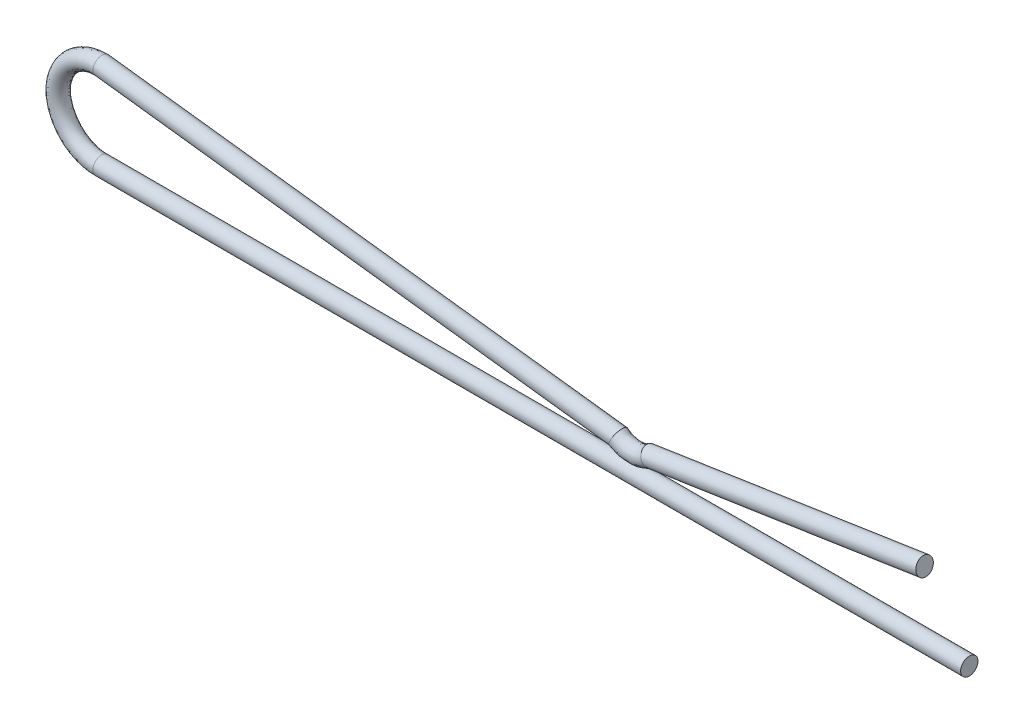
ISO-10303-21;
HEADER;
FILE_DESCRIPTION(('STEP AP214'),'2;1');
FILE_NAME('part.step','',(''),(''),'','','');
FILE_SCHEMA(('AUTOMOTIVE_DESIGN { 1 0 10303 214 1 1 1 1 }'));
ENDSEC;
DATA;
#1=APPLICATION_CONTEXT('core data for automotive mechanical design processes');
#2=APPLICATION_PROTOCOL_DEFINITION('international standard','automotive_design',2000,#1);
#3=PRODUCT_CONTEXT('',#1,'mechanical');
#4=PRODUCT('Part','Part','',(#3));
#5=PRODUCT_RELATED_PRODUCT_CATEGORY('part','',(#4));
#6=PRODUCT_DEFINITION_FORMATION('','',#4);
#7=PRODUCT_DEFINITION_CONTEXT('part definition',#1,'design');
#8=PRODUCT_DEFINITION('design','',#6,#7);
#9=PRODUCT_DEFINITION_SHAPE('','',#8);
#10=(LENGTH_UNIT() NAMED_UNIT(*) SI_UNIT(.MILLI.,.METRE.));
#11=(NAMED_UNIT(*) PLANE_ANGLE_UNIT() SI_UNIT($,.RADIAN.));
#12=(NAMED_UNIT(*) SI_UNIT($,.STERADIAN.) SOLID_ANGLE_UNIT());
#13=UNCERTAINTY_MEASURE_WITH_UNIT(LENGTH_MEASURE(1.E-05),#10,'distance_accuracy_value','');
#14=(GEOMETRIC_REPRESENTATION_CONTEXT(3) GLOBAL_UNCERTAINTY_ASSIGNED_CONTEXT((#13)) GLOBAL_UNIT_ASSIGNED_CONTEXT((#10,
#11,#12)) REPRESENTATION_CONTEXT('',''));
#15=CARTESIAN_POINT('',(0.,0.,0.));
#16=DIRECTION('',(0.,0.,1.));
#17=DIRECTION('',(1.,0.,0.));
#18=AXIS2_PLACEMENT_3D('',#15,#16,#17);
#19=CARTESIAN_POINT('',(-27.2506693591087,-18.6607844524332,0.));
#20=DIRECTION('',(1.,0.,0.));
#21=DIRECTION('',(0.,1.,0.));
#22=AXIS2_PLACEMENT_3D('',#19,#20,#21);
#23=CYLINDRICAL_SURFACE('',#22,0.0999999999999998);
#24=CARTESIAN_POINT('',(-27.2506693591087,-18.6607844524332,0.));
#25=DIRECTION('',(-1.,0.,0.));
#26=DIRECTION('',(0.,-1.,0.));
#27=AXIS2_PLACEMENT_3D('',#24,#25,#26);
#28=CIRCLE('',#27,0.0999999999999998);
#29=CARTESIAN_POINT('',(-27.2506693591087,-18.7607844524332,0.));
#30=VERTEX_POINT('',#29);
#31=EDGE_CURVE('E11',#30,#30,#28,.T.);
#32=ORIENTED_EDGE('',*,*,#31,.F.);
#33=EDGE_LOOP('',(#32));
#34=FACE_BOUND('',#33,.T.);
#35=CARTESIAN_POINT('',(-17.2506693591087,-18.6607844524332,0.));
#36=DIRECTION('',(-1.,0.,0.));
#37=DIRECTION('',(0.,-1.,0.));
#38=AXIS2_PLACEMENT_3D('',#35,#36,#37);
#39=CIRCLE('',#38,0.0999999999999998);
#40=CARTESIAN_POINT('',(-17.2506693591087,-18.7607844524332,0.));
#41=VERTEX_POINT('',#40);
#42=EDGE_CURVE('E43',#41,#41,#39,.T.);
#43=ORIENTED_EDGE('',*,*,#42,.T.);
#44=EDGE_LOOP('',(#43));
#45=FACE_BOUND('',#44,.T.);
#46=ADVANCED_FACE('F40',(#34,#45),#23,.T.);
#47=CARTESIAN_POINT('',(-17.2506693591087,-18.6607844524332,0.));
#48=DIRECTION('',(-1.,0.,0.));
#49=DIRECTION('',(0.,-1.,0.));
#50=AXIS2_PLACEMENT_3D('',#47,#48,#49);
#51=PLANE('',#50);
#52=ORIENTED_EDGE('',*,*,#42,.F.);
#53=EDGE_LOOP('',(#52));
#54=FACE_BOUND('',#53,.T.);
#55=ADVANCED_FACE('F97',(#54),#51,.F.);
#56=CARTESIAN_POINT('',(-27.2506693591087,-18.7607844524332,0.));
#57=CARTESIAN_POINT('',(-27.2730606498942,-18.7607844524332,0.));
#58=CARTESIAN_POINT('',(-27.3366927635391,-18.7571033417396,0.));
#59=CARTESIAN_POINT('',(-27.4232507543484,-18.7384235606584,0.));
#60=CARTESIAN_POINT('',(-27.5201436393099,-18.7007624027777,0.));
#61=CARTESIAN_POINT('',(-27.6088160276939,-18.6464794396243,0.));
#62=CARTESIAN_POINT('',(-27.6905179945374,-18.571954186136,0.));
#63=CARTESIAN_POINT('',(-27.7544950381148,-18.4879166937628,0.));
#64=CARTESIAN_POINT('',(-27.8065709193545,-18.3899068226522,0.));
#65=CARTESIAN_POINT('',(-27.8418276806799,-18.2799655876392,0.));
#66=CARTESIAN_POINT('',(-27.855144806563,-18.1607844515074,0.));
#67=CARTESIAN_POINT('',(-27.8418272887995,-18.0416033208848,0.));
#68=CARTESIAN_POINT('',(-27.8065724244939,-17.9316620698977,0.));
#69=CARTESIAN_POINT('',(-27.7544896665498,-17.8336522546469,0.));
#70=CARTESIAN_POINT('',(-27.6905365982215,-17.7496145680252,0.));
#71=CARTESIAN_POINT('',(-27.6087480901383,-17.6750900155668,0.));
#72=CARTESIAN_POINT('',(-27.5204200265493,-17.6208042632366,0.));
#73=CARTESIAN_POINT('',(-27.422378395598,-17.5831524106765,0.));
#74=CARTESIAN_POINT('',(-27.3391441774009,-17.5643734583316,0.));
#75=CARTESIAN_POINT('',(-27.2669528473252,-17.5607844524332,0.));
#76=CARTESIAN_POINT('',(-27.2445611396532,-17.5607844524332,0.));
#77=CARTESIAN_POINT('',(-27.2506693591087,-18.7607844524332,0.2));
#78=CARTESIAN_POINT('',(-27.2599588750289,-18.7607844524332,0.2));
#79=CARTESIAN_POINT('',(-27.3435719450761,-18.7571033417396,0.2));
#80=CARTESIAN_POINT('',(-27.4210768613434,-18.7384235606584,0.2));
#81=CARTESIAN_POINT('',(-27.520832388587,-18.7007624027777,0.2));
#82=CARTESIAN_POINT('',(-27.6086467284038,-18.6464794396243,0.2));
#83=CARTESIAN_POINT('',(-27.6905643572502,-18.571954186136,0.2));
#84=CARTESIAN_POINT('',(-27.7544816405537,-18.4879166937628,0.2));
#85=CARTESIAN_POINT('',(-27.806574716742,-18.3899068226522,0.2));
#86=CARTESIAN_POINT('',(-27.8418265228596,-18.2799655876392,0.2));
#87=CARTESIAN_POINT('',(-27.8551455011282,-18.1607844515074,0.2));
#88=CARTESIAN_POINT('',(-27.8418257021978,-18.0416033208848,0.2));
#89=CARTESIAN_POINT('',(-27.8065778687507,-17.9316620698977,0.2));
#90=CARTESIAN_POINT('',(-27.7544703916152,-17.8336522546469,0.2));
#91=CARTESIAN_POINT('',(-27.690603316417,-17.7496145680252,0.2));
#92=CARTESIAN_POINT('',(-27.6085044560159,-17.6750900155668,0.2));
#93=CARTESIAN_POINT('',(-27.5214111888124,-17.6208042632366,0.2));
#94=CARTESIAN_POINT('',(-27.419249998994,-17.5831524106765,0.2));
#95=CARTESIAN_POINT('',(-27.3490924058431,-17.5643734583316,0.2));
#96=CARTESIAN_POINT('',(-27.2477561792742,-17.5607844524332,0.199999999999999));
#97=CARTESIAN_POINT('',(-27.2445611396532,-17.5607844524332,0.199999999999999));
#98=CARTESIAN_POINT('',(-27.2506693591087,-18.5607844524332,0.2));
#99=CARTESIAN_POINT('',(-27.2599588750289,-18.5607844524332,0.2));
#100=CARTESIAN_POINT('',(-27.3118460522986,-18.5583018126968,0.2));
#101=CARTESIAN_POINT('',(-27.3651582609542,-18.5457956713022,0.2));
#102=CARTESIAN_POINT('',(-27.4295654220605,-18.5215023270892,0.2));
#103=CARTESIAN_POINT('',(-27.4905377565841,-18.4836006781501,0.2));
#104=CARTESIAN_POINT('',(-27.5405754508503,-18.4378004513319,0.2));
#105=CARTESIAN_POINT('',(-27.5855419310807,-18.379394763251,0.2));
#106=CARTESIAN_POINT('',(-27.621337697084,-18.3116926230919,0.2));
#107=CARTESIAN_POINT('',(-27.6450904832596,-18.2371742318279,0.2));
#108=CARTESIAN_POINT('',(-27.6534931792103,-18.1607844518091,0.2));
#109=CARTESIAN_POINT('',(-27.6450905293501,-18.0843946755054,0.2));
#110=CARTESIAN_POINT('',(-27.6213375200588,-18.0098762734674,0.2));
#111=CARTESIAN_POINT('',(-27.5855425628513,-17.9421741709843,0.2));
#112=CARTESIAN_POINT('',(-27.5405732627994,-17.8837683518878,0.2));
#113=CARTESIAN_POINT('',(-27.490545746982,-17.8379685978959,0.2));
#114=CARTESIAN_POINT('',(-27.4295329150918,-17.8000650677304,0.2));
#115=CARTESIAN_POINT('',(-27.36526086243,-17.7757779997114,0.2));
#116=CARTESIAN_POINT('',(-27.3113210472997,-17.7632053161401,0.2));
#117=CARTESIAN_POINT('',(-27.2599726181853,-17.7607844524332,0.2));
#118=CARTESIAN_POINT('',(-27.2567775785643,-17.7607844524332,0.2));
#119=CARTESIAN_POINT('',(-27.2506693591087,-18.5607844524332,0.));
#120=CARTESIAN_POINT('',(-27.2665097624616,-18.5607844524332,0.));
#121=CARTESIAN_POINT('',(-27.3084064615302,-18.5583018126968,0.));
#122=CARTESIAN_POINT('',(-27.3662452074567,-18.5457956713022,0.));
#123=CARTESIAN_POINT('',(-27.4292210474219,-18.5215023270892,0.));
#124=CARTESIAN_POINT('',(-27.4906224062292,-18.4836006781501,0.));
#125=CARTESIAN_POINT('',(-27.5405522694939,-18.4378004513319,0.));
#126=CARTESIAN_POINT('',(-27.5855486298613,-18.379394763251,0.));
#127=CARTESIAN_POINT('',(-27.6213357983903,-18.3116926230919,0.));
#128=CARTESIAN_POINT('',(-27.6450910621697,-18.2371742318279,0.));
#129=CARTESIAN_POINT('',(-27.6534928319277,-18.1607844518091,0.));
#130=CARTESIAN_POINT('',(-27.645091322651,-18.0843946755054,0.));
#131=CARTESIAN_POINT('',(-27.6213347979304,-18.0098762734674,0.));
#132=CARTESIAN_POINT('',(-27.5855522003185,-17.9421741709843,0.));
#133=CARTESIAN_POINT('',(-27.5405399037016,-17.8837683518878,0.));
#134=CARTESIAN_POINT('',(-27.4906675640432,-17.8379685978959,0.));
#135=CARTESIAN_POINT('',(-27.4290373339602,-17.8000650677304,0.));
#136=CARTESIAN_POINT('',(-27.366825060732,-17.7757779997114,0.));
#137=CARTESIAN_POINT('',(-27.3063469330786,-17.76320531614,0.));
#138=CARTESIAN_POINT('',(-27.2695709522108,-17.7607844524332,0.));
#139=CARTESIAN_POINT('',(-27.2567775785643,-17.7607844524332,0.));
#140=CARTESIAN_POINT('',(-27.2506693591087,-18.5607844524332,-0.2));
#141=CARTESIAN_POINT('',(-27.2730606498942,-18.5607844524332,-0.2));
#142=CARTESIAN_POINT('',(-27.3049668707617,-18.5583018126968,-0.2));
#143=CARTESIAN_POINT('',(-27.3673321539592,-18.5457956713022,-0.2));
#144=CARTESIAN_POINT('',(-27.4288766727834,-18.5215023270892,-0.2));
#145=CARTESIAN_POINT('',(-27.4907070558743,-18.4836006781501,-0.2));
#146=CARTESIAN_POINT('',(-27.5405290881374,-18.4378004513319,-0.2));
#147=CARTESIAN_POINT('',(-27.5855553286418,-18.379394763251,-0.2));
#148=CARTESIAN_POINT('',(-27.6213338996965,-18.3116926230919,-0.2));
#149=CARTESIAN_POINT('',(-27.6450916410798,-18.2371742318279,-0.2));
#150=CARTESIAN_POINT('',(-27.6534924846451,-18.1607844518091,-0.2));
#151=CARTESIAN_POINT('',(-27.6450921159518,-18.0843946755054,-0.2));
#152=CARTESIAN_POINT('',(-27.621332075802,-18.0098762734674,-0.2));
#153=CARTESIAN_POINT('',(-27.5855618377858,-17.9421741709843,-0.2));
#154=CARTESIAN_POINT('',(-27.5405065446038,-17.8837683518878,-0.2));
#155=CARTESIAN_POINT('',(-27.4907893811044,-17.8379685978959,-0.2));
#156=CARTESIAN_POINT('',(-27.4285417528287,-17.8000650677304,-0.2));
#157=CARTESIAN_POINT('',(-27.368389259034,-17.7757779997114,-0.2));
#158=CARTESIAN_POINT('',(-27.3013728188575,-17.7632053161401,-0.2));
#159=CARTESIAN_POINT('',(-27.2791692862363,-17.7607844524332,-0.199999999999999));
#160=CARTESIAN_POINT('',(-27.2567775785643,-17.7607844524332,-0.199999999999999));
#161=CARTESIAN_POINT('',(-27.2506693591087,-18.7607844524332,-0.2));
#162=CARTESIAN_POINT('',(-27.2861624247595,-18.7607844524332,-0.2));
#163=CARTESIAN_POINT('',(-27.3298135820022,-18.7571033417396,-0.2));
#164=CARTESIAN_POINT('',(-27.4254246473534,-18.7384235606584,-0.2));
#165=CARTESIAN_POINT('',(-27.5194548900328,-18.7007624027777,-0.2));
#166=CARTESIAN_POINT('',(-27.6089853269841,-18.6464794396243,-0.2));
#167=CARTESIAN_POINT('',(-27.6904716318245,-18.571954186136,-0.2));
#168=CARTESIAN_POINT('',(-27.7545084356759,-18.4879166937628,-0.2));
#169=CARTESIAN_POINT('',(-27.806567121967,-18.3899068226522,-0.2));
#170=CARTESIAN_POINT('',(-27.8418288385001,-18.2799655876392,-0.2));
#171=CARTESIAN_POINT('',(-27.8551441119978,-18.1607844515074,-0.2));
#172=CARTESIAN_POINT('',(-27.8418288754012,-18.0416033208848,-0.2));
#173=CARTESIAN_POINT('',(-27.806566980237,-17.9316620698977,-0.2));
#174=CARTESIAN_POINT('',(-27.7545089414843,-17.8336522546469,-0.2));
#175=CARTESIAN_POINT('',(-27.690469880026,-17.7496145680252,-0.2));
#176=CARTESIAN_POINT('',(-27.6089917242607,-17.6750900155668,-0.2));
#177=CARTESIAN_POINT('',(-27.5194288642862,-17.6208042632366,-0.2));
#178=CARTESIAN_POINT('',(-27.425506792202,-17.5831524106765,-0.2));
#179=CARTESIAN_POINT('',(-27.3291959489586,-17.5643734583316,-0.2));
#180=CARTESIAN_POINT('',(-27.2861495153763,-17.5607844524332,-0.2));
#181=CARTESIAN_POINT('',(-27.2445611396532,-17.5607844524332,-0.2));
#182=CARTESIAN_POINT('',(-27.2506693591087,-18.7607844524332,0.));
#183=CARTESIAN_POINT('',(-27.2730606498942,-18.7607844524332,0.));
#184=CARTESIAN_POINT('',(-27.3366927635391,-18.7571033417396,0.));
#185=CARTESIAN_POINT('',(-27.4232507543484,-18.7384235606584,0.));
#186=CARTESIAN_POINT('',(-27.5201436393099,-18.7007624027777,0.));
#187=CARTESIAN_POINT('',(-27.6088160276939,-18.6464794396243,0.));
#188=CARTESIAN_POINT('',(-27.6905179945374,-18.571954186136,0.));
#189=CARTESIAN_POINT('',(-27.7544950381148,-18.4879166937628,0.));
#190=CARTESIAN_POINT('',(-27.8065709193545,-18.3899068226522,0.));
#191=CARTESIAN_POINT('',(-27.8418276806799,-18.2799655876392,0.));
#192=CARTESIAN_POINT('',(-27.855144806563,-18.1607844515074,0.));
#193=CARTESIAN_POINT('',(-27.8418272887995,-18.0416033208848,0.));
#194=CARTESIAN_POINT('',(-27.8065724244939,-17.9316620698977,0.));
#195=CARTESIAN_POINT('',(-27.7544896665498,-17.8336522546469,0.));
#196=CARTESIAN_POINT('',(-27.6905365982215,-17.7496145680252,0.));
#197=CARTESIAN_POINT('',(-27.6087480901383,-17.6750900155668,0.));
#198=CARTESIAN_POINT('',(-27.5204200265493,-17.6208042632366,0.));
#199=CARTESIAN_POINT('',(-27.422378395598,-17.5831524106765,0.));
#200=CARTESIAN_POINT('',(-27.3391441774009,-17.5643734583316,0.));
#201=CARTESIAN_POINT('',(-27.2669528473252,-17.5607844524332,0.));
#202=CARTESIAN_POINT('',(-27.2445611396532,-17.5607844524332,0.));
#203=(BOUNDED_SURFACE() B_SPLINE_SURFACE(3,3,((#56,#57,#58,#59,#60,#61,#62,#63,#64,#65,#66,#67,
#68,#69,#70,#71,#72,#73,#74,#75,#76),(#77,#78,#79,#80,#81,#82,#83,#84,#85,#86,#87,#88,#89,#90,
#91,#92,#93,#94,#95,#96,#97),(#98,#99,#100,#101,#102,#103,#104,#105,#106,#107,#108,#109,#110,
#111,#112,#113,#114,#115,#116,#117,#118),(#119,#120,#121,#122,#123,#124,#125,#126,#127,#128,
#129,#130,#131,#132,#133,#134,#135,#136,#137,#138,#139),(#140,#141,#142,#143,#144,#145,#146,
#147,#148,#149,#150,#151,#152,#153,#154,#155,#156,#157,#158,#159,#160),(#161,#162,#163,#164,
#165,#166,#167,#168,#169,#170,#171,#172,#173,#174,#175,#176,#177,#178,#179,#180,#181),(#182,
#183,#184,#185,#186,#187,#188,#189,#190,#191,#192,#193,#194,#195,#196,#197,#198,#199,#200,#201,
#202)),.UNSPECIFIED.,.T.,.F.,.F.) B_SPLINE_SURFACE_WITH_KNOTS((4,3,4),(4,1,1,1,1,1,1,1,1,1,1,1,
1,1,1,1,1,1,4),(0.,0.5,1.),(0.,0.0428211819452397,0.0912193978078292,0.145066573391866,
0.205092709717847,0.258565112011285,0.31568185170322,0.37535972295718,0.436777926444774,
0.499729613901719,0.562681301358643,0.624099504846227,0.683777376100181,0.74089411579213,
0.79436651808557,0.854392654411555,0.90823982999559,0.95663804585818,1.),
.UNSPECIFIED.) GEOMETRIC_REPRESENTATION_ITEM() RATIONAL_B_SPLINE_SURFACE(((1.,1.,1.,1.,1.,1.,1.,
1.,1.,1.,1.,1.,1.,1.,1.,1.,1.,1.,1.,1.,1.),(0.333333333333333,0.333333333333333,
0.333333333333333,0.333333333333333,0.333333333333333,0.333333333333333,0.333333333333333,
0.333333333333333,0.333333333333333,0.333333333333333,0.333333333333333,0.333333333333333,
0.333333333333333,0.333333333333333,0.333333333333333,0.333333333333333,0.333333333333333,
0.333333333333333,0.333333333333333,0.333333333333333,0.333333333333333),(0.333333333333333,
0.333333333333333,0.333333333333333,0.333333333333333,0.333333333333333,0.333333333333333,
0.333333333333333,0.333333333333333,0.333333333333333,0.333333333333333,0.333333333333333,
0.333333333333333,0.333333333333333,0.333333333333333,0.333333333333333,0.333333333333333,
0.333333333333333,0.333333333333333,0.333333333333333,0.333333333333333,0.333333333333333),(1.,
1.,1.,1.,1.,1.,1.,1.,1.,1.,1.,1.,1.,1.,1.,1.,1.,1.,1.,1.,1.),(0.333333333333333,
0.333333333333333,0.333333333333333,0.333333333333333,0.333333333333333,0.333333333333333,
0.333333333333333,0.333333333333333,0.333333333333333,0.333333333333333,0.333333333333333,
0.333333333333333,0.333333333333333,0.333333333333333,0.333333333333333,0.333333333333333,
0.333333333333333,0.333333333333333,0.333333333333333,0.333333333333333,0.333333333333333),
(0.333333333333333,0.333333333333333,0.333333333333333,0.333333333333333,0.333333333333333,
0.333333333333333,0.333333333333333,0.333333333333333,0.333333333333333,0.333333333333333,
0.333333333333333,0.333333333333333,0.333333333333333,0.333333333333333,0.333333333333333,
0.333333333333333,0.333333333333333,0.333333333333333,0.333333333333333,0.333333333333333,
0.333333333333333),(1.,1.,1.,1.,1.,1.,1.,1.,1.,1.,1.,1.,1.,1.,1.,1.,1.,1.,1.,1.,1.))) REPRESENTATION_ITEM('') SURFACE());
#204=CARTESIAN_POINT('',(-27.2445611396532,-17.5607844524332,0.));
#205=CARTESIAN_POINT('',(-27.2445611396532,-17.5607844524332,-0.2));
#206=CARTESIAN_POINT('',(-27.2567775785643,-17.7607844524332,-0.199999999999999));
#207=CARTESIAN_POINT('',(-27.2567775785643,-17.7607844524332,0.));
#208=CARTESIAN_POINT('',(-27.2567775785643,-17.7607844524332,0.2));
#209=CARTESIAN_POINT('',(-27.2445611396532,-17.5607844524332,0.199999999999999));
#210=CARTESIAN_POINT('',(-27.2445611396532,-17.5607844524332,0.));
#211=(BOUNDED_CURVE() B_SPLINE_CURVE(3,(#204,#205,#206,#207,#208,#209,#210),.UNSPECIFIED.,.T.,
.F.) B_SPLINE_CURVE_WITH_KNOTS((4,3,4),(0.,0.5,1.),
.UNSPECIFIED.) CURVE() GEOMETRIC_REPRESENTATION_ITEM() RATIONAL_B_SPLINE_CURVE((1.,
0.333333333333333,0.333333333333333,1.,0.333333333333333,0.333333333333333,1.)) REPRESENTATION_ITEM(''));
#212=CARTESIAN_POINT('',(-27.2445611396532,-17.5607844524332,0.));
#213=VERTEX_POINT('',#212);
#214=EDGE_CURVE('E56',#213,#213,#211,.T.);
#215=ORIENTED_EDGE('',*,*,#31,.T.);
#216=EDGE_LOOP('',(#215));
#217=FACE_BOUND('',#216,.T.);
#218=ORIENTED_EDGE('',*,*,#214,.T.);
#219=EDGE_LOOP('',(#218));
#220=FACE_BOUND('',#219,.T.);
#221=ADVANCED_FACE('F102',(#217,#220),#203,.T.);
#222=CARTESIAN_POINT('',(-27.2445611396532,-17.5607844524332,0.));
#223=CARTESIAN_POINT('',(-21.2542320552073,-18.2953299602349,0.));
#224=CARTESIAN_POINT('',(-27.2445611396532,-17.5607844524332,-0.2));
#225=CARTESIAN_POINT('',(-21.2542320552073,-18.2953299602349,-0.2));
#226=CARTESIAN_POINT('',(-27.2567775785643,-17.7607844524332,-0.199999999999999));
#227=CARTESIAN_POINT('',(-21.3363186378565,-18.4867623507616,-0.199999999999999));
#228=CARTESIAN_POINT('',(-27.2567775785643,-17.7607844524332,0.));
#229=CARTESIAN_POINT('',(-21.3363186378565,-18.4867623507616,0.));
#230=CARTESIAN_POINT('',(-27.2567775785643,-17.7607844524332,0.2));
#231=CARTESIAN_POINT('',(-21.3363186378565,-18.4867623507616,0.2));
#232=CARTESIAN_POINT('',(-27.2445611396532,-17.5607844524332,0.199999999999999));
#233=CARTESIAN_POINT('',(-21.2542320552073,-18.2953299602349,0.199999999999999));
#234=CARTESIAN_POINT('',(-27.2445611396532,-17.5607844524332,0.));
#235=CARTESIAN_POINT('',(-21.2542320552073,-18.2953299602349,0.));
#236=(BOUNDED_SURFACE() B_SPLINE_SURFACE(3,1,((#222,#223),(#224,#225),(#226,#227),(#228,#229),
(#230,#231),(#232,#233),(#234,#235)),.UNSPECIFIED.,.T.,.F.,.F.) B_SPLINE_SURFACE_WITH_KNOTS((4,
3,4),(2,2),(0.,0.5,1.),(0.,1.),
.UNSPECIFIED.) GEOMETRIC_REPRESENTATION_ITEM() RATIONAL_B_SPLINE_SURFACE(((1.,1.),
(0.333333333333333,0.333333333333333),(0.333333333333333,0.333333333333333),(1.,1.),
(0.333333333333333,0.333333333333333),(0.333333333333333,0.333333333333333),(1.,1.))) REPRESENTATION_ITEM('') SURFACE());
#237=CARTESIAN_POINT('',(-21.2542320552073,-18.2953299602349,0.));
#238=CARTESIAN_POINT('',(-21.2542320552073,-18.2953299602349,-0.2));
#239=CARTESIAN_POINT('',(-21.3363186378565,-18.4867623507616,-0.199999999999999));
#240=CARTESIAN_POINT('',(-21.3363186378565,-18.4867623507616,0.));
#241=CARTESIAN_POINT('',(-21.3363186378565,-18.4867623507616,0.2));
#242=CARTESIAN_POINT('',(-21.2542320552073,-18.2953299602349,0.199999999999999));
#243=CARTESIAN_POINT('',(-21.2542320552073,-18.2953299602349,0.));
#244=(BOUNDED_CURVE() B_SPLINE_CURVE(3,(#237,#238,#239,#240,#241,#242,#243),.UNSPECIFIED.,.T.,
.F.) B_SPLINE_CURVE_WITH_KNOTS((4,3,4),(0.,0.5,1.),
.UNSPECIFIED.) CURVE() GEOMETRIC_REPRESENTATION_ITEM() RATIONAL_B_SPLINE_CURVE((1.,
0.333333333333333,0.333333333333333,1.,0.333333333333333,0.333333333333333,1.)) REPRESENTATION_ITEM(''));
#245=CARTESIAN_POINT('',(-21.2542320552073,-18.2953299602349,0.));
#246=VERTEX_POINT('',#245);
#247=EDGE_CURVE('E50',#246,#246,#244,.F.);
#248=ORIENTED_EDGE('',*,*,#214,.F.);
#249=EDGE_LOOP('',(#248));
#250=FACE_BOUND('',#249,.T.);
#251=ORIENTED_EDGE('',*,*,#247,.F.);
#252=EDGE_LOOP('',(#251));
#253=FACE_BOUND('',#252,.T.);
#254=ADVANCED_FACE('F93',(#250,#253),#236,.F.);
#255=CARTESIAN_POINT('',(-21.2542320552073,-18.2953299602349,0.));
#256=CARTESIAN_POINT('',(-21.240800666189,-18.3063738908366,0.));
#257=CARTESIAN_POINT('',(-21.2012912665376,-18.3362410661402,0.));
#258=CARTESIAN_POINT('',(-21.1751536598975,-18.3426597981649,0.));
#259=CARTESIAN_POINT('',(-21.1338699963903,-18.35238519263,0.));
#260=CARTESIAN_POINT('',(-21.0934462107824,-18.3540187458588,0.));
#261=CARTESIAN_POINT('',(-21.0505579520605,-18.3481092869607,0.));
#262=CARTESIAN_POINT('',(-21.0198635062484,-18.3417093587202,0.));
#263=CARTESIAN_POINT('',(-20.9834383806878,-18.3184422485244,0.));
#264=CARTESIAN_POINT('',(-20.9686357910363,-18.3078212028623,0.));
#265=CARTESIAN_POINT('',(-21.2542320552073,-18.2953299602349,0.199999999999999));
#266=CARTESIAN_POINT('',(-21.2461854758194,-18.3019462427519,0.199999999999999));
#267=CARTESIAN_POINT('',(-21.1988755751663,-18.338226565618,0.199999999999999));
#268=CARTESIAN_POINT('',(-21.1758199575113,-18.3421146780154,0.199999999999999));
#269=CARTESIAN_POINT('',(-21.133679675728,-18.3525310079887,0.199999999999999));
#270=CARTESIAN_POINT('',(-21.0935243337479,-18.3539955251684,0.199999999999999));
#271=CARTESIAN_POINT('',(-21.050442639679,-18.3480473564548,0.199999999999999));
#272=CARTESIAN_POINT('',(-21.0202338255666,-18.3419691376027,0.2));
#273=CARTESIAN_POINT('',(-20.9826376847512,-18.3178677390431,0.199999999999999));
#274=CARTESIAN_POINT('',(-20.9686357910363,-18.3078212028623,0.199999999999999));
#275=CARTESIAN_POINT('',(-21.3363186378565,-18.4867623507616,0.2));
#276=CARTESIAN_POINT('',(-21.3282720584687,-18.4933786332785,0.2));
#277=CARTESIAN_POINT('',(-21.3040870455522,-18.5060258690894,0.2));
#278=CARTESIAN_POINT('',(-21.2266393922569,-18.5387225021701,0.2));
#279=CARTESIAN_POINT('',(-21.158985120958,-18.5511052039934,0.2));
#280=CARTESIAN_POINT('',(-21.0854469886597,-18.554327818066,0.2));
#281=CARTESIAN_POINT('',(-21.0148424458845,-18.5475258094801,0.2));
#282=CARTESIAN_POINT('',(-20.9322706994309,-18.5200625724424,0.199999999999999));
#283=CARTESIAN_POINT('',(-20.905062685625,-18.508363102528,0.2));
#284=CARTESIAN_POINT('',(-20.8910607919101,-18.4983165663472,0.2));
#285=CARTESIAN_POINT('',(-21.3363186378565,-18.4867623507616,0.));
#286=CARTESIAN_POINT('',(-21.3255796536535,-18.4955924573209,0.));
#287=CARTESIAN_POINT('',(-21.3052948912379,-18.5050331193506,0.));
#288=CARTESIAN_POINT('',(-21.2263062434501,-18.5389950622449,0.));
#289=CARTESIAN_POINT('',(-21.1590802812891,-18.5510322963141,0.));
#290=CARTESIAN_POINT('',(-21.0854079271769,-18.5543394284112,0.));
#291=CARTESIAN_POINT('',(-21.0149001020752,-18.547556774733,0.));
#292=CARTESIAN_POINT('',(-20.9320855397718,-18.5199326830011,0.));
#293=CARTESIAN_POINT('',(-20.9054630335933,-18.5086503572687,0.));
#294=CARTESIAN_POINT('',(-20.8910607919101,-18.4983165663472,0.));
#295=CARTESIAN_POINT('',(-21.3363186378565,-18.4867623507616,-0.199999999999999));
#296=CARTESIAN_POINT('',(-21.3228872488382,-18.4978062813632,-0.199999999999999));
#297=CARTESIAN_POINT('',(-21.3065027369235,-18.5040403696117,-0.199999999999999));
#298=CARTESIAN_POINT('',(-21.2259730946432,-18.5392676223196,-0.199999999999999));
#299=CARTESIAN_POINT('',(-21.1591754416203,-18.5509593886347,-0.199999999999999));
#300=CARTESIAN_POINT('',(-21.0853688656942,-18.5543510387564,-0.199999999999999));
#301=CARTESIAN_POINT('',(-21.0149577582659,-18.547587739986,-0.199999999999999));
#302=CARTESIAN_POINT('',(-20.9319003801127,-18.5198027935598,-0.2));
#303=CARTESIAN_POINT('',(-20.9058633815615,-18.5089376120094,-0.199999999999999));
#304=CARTESIAN_POINT('',(-20.8910607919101,-18.4983165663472,-0.199999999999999));
#305=CARTESIAN_POINT('',(-21.2542320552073,-18.2953299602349,-0.2));
#306=CARTESIAN_POINT('',(-21.2354158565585,-18.3108015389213,-0.2));
#307=CARTESIAN_POINT('',(-21.2037069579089,-18.3342555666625,-0.2));
#308=CARTESIAN_POINT('',(-21.1744873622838,-18.3432049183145,-0.2));
#309=CARTESIAN_POINT('',(-21.1340603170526,-18.3522393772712,-0.2));
#310=CARTESIAN_POINT('',(-21.0933680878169,-18.3540419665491,-0.2));
#311=CARTESIAN_POINT('',(-21.050673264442,-18.3481712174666,-0.2));
#312=CARTESIAN_POINT('',(-21.0194931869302,-18.3414495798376,-0.199999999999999));
#313=CARTESIAN_POINT('',(-20.9842390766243,-18.3190167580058,-0.2));
#314=CARTESIAN_POINT('',(-20.9686357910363,-18.3078212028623,-0.2));
#315=CARTESIAN_POINT('',(-21.2542320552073,-18.2953299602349,0.));
#316=CARTESIAN_POINT('',(-21.240800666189,-18.3063738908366,0.));
#317=CARTESIAN_POINT('',(-21.2012912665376,-18.3362410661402,0.));
#318=CARTESIAN_POINT('',(-21.1751536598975,-18.3426597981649,0.));
#319=CARTESIAN_POINT('',(-21.1338699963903,-18.35238519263,0.));
#320=CARTESIAN_POINT('',(-21.0934462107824,-18.3540187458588,0.));
#321=CARTESIAN_POINT('',(-21.0505579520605,-18.3481092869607,0.));
#322=CARTESIAN_POINT('',(-21.0198635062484,-18.3417093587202,0.));
#323=CARTESIAN_POINT('',(-20.9834383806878,-18.3184422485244,0.));
#324=CARTESIAN_POINT('',(-20.9686357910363,-18.3078212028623,0.));
#325=(BOUNDED_SURFACE() B_SPLINE_SURFACE(3,3,((#255,#256,#257,#258,#259,#260,#261,#262,#263,
#264),(#265,#266,#267,#268,#269,#270,#271,#272,#273,#274),(#275,#276,#277,#278,#279,#280,#281,
#282,#283,#284),(#285,#286,#287,#288,#289,#290,#291,#292,#293,#294),(#295,#296,#297,#298,#299,
#300,#301,#302,#303,#304),(#305,#306,#307,#308,#309,#310,#311,#312,#313,#314),(#315,#316,#317,
#318,#319,#320,#321,#322,#323,#324)),.UNSPECIFIED.,.T.,.F.,.F.) B_SPLINE_SURFACE_WITH_KNOTS((4,
3,4),(4,1,1,1,1,1,1,4),(0.,0.5,1.),(0.,0.140894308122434,0.27743494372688,0.419016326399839,
0.56257262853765,0.711296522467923,0.854773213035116,1.),
.UNSPECIFIED.) GEOMETRIC_REPRESENTATION_ITEM() RATIONAL_B_SPLINE_SURFACE(((1.,1.,1.,1.,1.,1.,1.,
1.,1.,1.),(0.333333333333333,0.333333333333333,0.333333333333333,0.333333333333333,
0.333333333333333,0.333333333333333,0.333333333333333,0.333333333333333,0.333333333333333,
0.333333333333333),(0.333333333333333,0.333333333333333,0.333333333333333,0.333333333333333,
0.333333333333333,0.333333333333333,0.333333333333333,0.333333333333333,0.333333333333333,
0.333333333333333),(1.,1.,1.,1.,1.,1.,1.,1.,1.,1.),(0.333333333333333,0.333333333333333,
0.333333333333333,0.333333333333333,0.333333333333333,0.333333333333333,0.333333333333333,
0.333333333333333,0.333333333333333,0.333333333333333),(0.333333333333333,0.333333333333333,
0.333333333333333,0.333333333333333,0.333333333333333,0.333333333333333,0.333333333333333,
0.333333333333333,0.333333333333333,0.333333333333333),(1.,1.,1.,1.,1.,1.,1.,1.,1.,1.))) REPRESENTATION_ITEM('') SURFACE());
#326=CARTESIAN_POINT('',(-20.9686357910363,-18.3078212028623,0.));
#327=CARTESIAN_POINT('',(-20.9686357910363,-18.3078212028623,-0.2));
#328=CARTESIAN_POINT('',(-20.8910607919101,-18.4983165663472,-0.199999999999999));
#329=CARTESIAN_POINT('',(-20.8910607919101,-18.4983165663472,0.));
#330=CARTESIAN_POINT('',(-20.8910607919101,-18.4983165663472,0.2));
#331=CARTESIAN_POINT('',(-20.9686357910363,-18.3078212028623,0.199999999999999));
#332=CARTESIAN_POINT('',(-20.9686357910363,-18.3078212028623,0.));
#333=(BOUNDED_CURVE() B_SPLINE_CURVE(3,(#326,#327,#328,#329,#330,#331,#332),.UNSPECIFIED.,.T.,
.F.) B_SPLINE_CURVE_WITH_KNOTS((4,3,4),(0.,0.5,1.),
.UNSPECIFIED.) CURVE() GEOMETRIC_REPRESENTATION_ITEM() RATIONAL_B_SPLINE_CURVE((1.,
0.333333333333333,0.333333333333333,1.,0.333333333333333,0.333333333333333,1.)) REPRESENTATION_ITEM(''));
#334=CARTESIAN_POINT('',(-20.9686357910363,-18.3078212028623,0.));
#335=VERTEX_POINT('',#334);
#336=EDGE_CURVE('E70',#335,#335,#333,.T.);
#337=ORIENTED_EDGE('',*,*,#247,.T.);
#338=EDGE_LOOP('',(#337));
#339=FACE_BOUND('',#338,.T.);
#340=ORIENTED_EDGE('',*,*,#336,.T.);
#341=EDGE_LOOP('',(#340));
#342=FACE_BOUND('',#341,.T.);
#343=ADVANCED_FACE('F79',(#339,#342),#325,.T.);
#344=CARTESIAN_POINT('',(-17.7512409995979,-18.0203735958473,0.));
#345=DIRECTION('',(0.988612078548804,0.150486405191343,0.));
#346=DIRECTION('',(-0.150486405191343,0.988612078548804,0.));
#347=AXIS2_PLACEMENT_3D('',#344,#345,#346);
#348=PLANE('',#347);
#349=CARTESIAN_POINT('',(-17.7662896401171,-17.9215123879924,0.));
#350=DIRECTION('',(0.988612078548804,0.150486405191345,0.));
#351=DIRECTION('',(-0.150486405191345,0.988612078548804,0.));
#352=AXIS2_PLACEMENT_3D('',#349,#350,#351);
#353=CIRCLE('',#352,0.100000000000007);
#354=CARTESIAN_POINT('',(-17.7813382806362,-17.8226511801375,0.));
#355=VERTEX_POINT('',#354);
#356=EDGE_CURVE('E64',#355,#355,#353,.T.);
#357=ORIENTED_EDGE('',*,*,#356,.T.);
#358=EDGE_LOOP('',(#357));
#359=FACE_BOUND('',#358,.T.);
#360=ADVANCED_FACE('F84',(#359),#348,.T.);
#361=CARTESIAN_POINT('',(-20.9686357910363,-18.3078212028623,0.));
#362=CARTESIAN_POINT('',(-17.7813382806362,-17.8226511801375,0.));
#363=CARTESIAN_POINT('',(-20.9686357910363,-18.3078212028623,-0.2));
#364=CARTESIAN_POINT('',(-17.7813382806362,-17.8226511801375,-0.2));
#365=CARTESIAN_POINT('',(-20.8910607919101,-18.4983165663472,-0.199999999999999));
#366=CARTESIAN_POINT('',(-17.7512409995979,-18.0203735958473,-0.199999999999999));
#367=CARTESIAN_POINT('',(-20.8910607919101,-18.4983165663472,0.));
#368=CARTESIAN_POINT('',(-17.7512409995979,-18.0203735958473,0.));
#369=CARTESIAN_POINT('',(-20.8910607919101,-18.4983165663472,0.2));
#370=CARTESIAN_POINT('',(-17.7512409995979,-18.0203735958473,0.2));
#371=CARTESIAN_POINT('',(-20.9686357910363,-18.3078212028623,0.199999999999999));
#372=CARTESIAN_POINT('',(-17.7813382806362,-17.8226511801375,0.199999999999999));
#373=CARTESIAN_POINT('',(-20.9686357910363,-18.3078212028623,0.));
#374=CARTESIAN_POINT('',(-17.7813382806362,-17.8226511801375,0.));
#375=(BOUNDED_SURFACE() B_SPLINE_SURFACE(3,1,((#361,#362),(#363,#364),(#365,#366),(#367,#368),
(#369,#370),(#371,#372),(#373,#374)),.UNSPECIFIED.,.T.,.F.,.F.) B_SPLINE_SURFACE_WITH_KNOTS((4,
3,4),(2,2),(0.,0.5,1.),(0.,1.),
.UNSPECIFIED.) GEOMETRIC_REPRESENTATION_ITEM() RATIONAL_B_SPLINE_SURFACE(((1.,1.),
(0.333333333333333,0.333333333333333),(0.333333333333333,0.333333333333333),(1.,1.),
(0.333333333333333,0.333333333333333),(0.333333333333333,0.333333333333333),(1.,1.))) REPRESENTATION_ITEM('') SURFACE());
#376=ORIENTED_EDGE('',*,*,#336,.F.);
#377=EDGE_LOOP('',(#376));
#378=FACE_BOUND('',#377,.T.);
#379=ORIENTED_EDGE('',*,*,#356,.F.);
#380=EDGE_LOOP('',(#379));
#381=FACE_BOUND('',#380,.T.);
#382=ADVANCED_FACE('F81',(#378,#381),#375,.F.);
#383=CLOSED_SHELL('',(#46,#55,#221,#254,#343,#360,#382));
#384=MANIFOLD_SOLID_BREP('B2',#383);
#385=ADVANCED_BREP_SHAPE_REPRESENTATION('',(#18,#384),#14);
#386=SHAPE_DEFINITION_REPRESENTATION(#9,#385);
ENDSEC;
END-ISO-10303-21;
